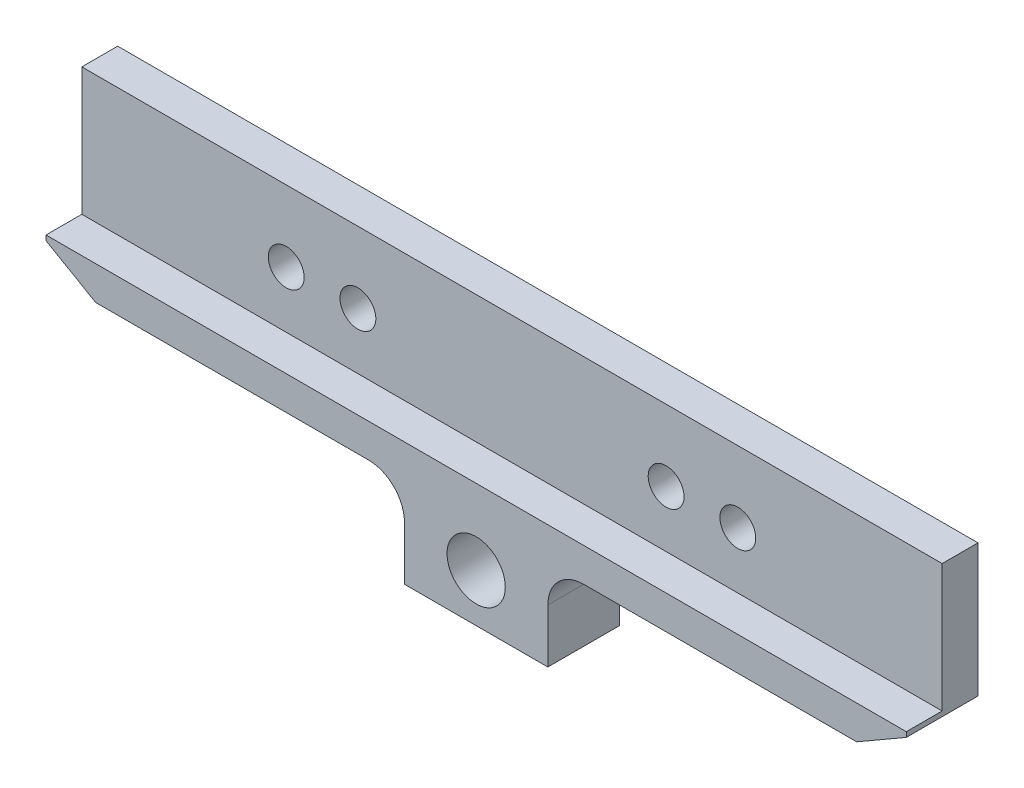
ISO-10303-21;
HEADER;
FILE_DESCRIPTION(('STEP AP214'),'2;1');
FILE_NAME('part.step','',(''),(''),'','','');
FILE_SCHEMA(('AUTOMOTIVE_DESIGN { 1 0 10303 214 1 1 1 1 }'));
ENDSEC;
DATA;
#1=APPLICATION_CONTEXT('core data for automotive mechanical design processes');
#2=APPLICATION_PROTOCOL_DEFINITION('international standard','automotive_design',2000,#1);
#3=PRODUCT_CONTEXT('',#1,'mechanical');
#4=PRODUCT('Part','Part','',(#3));
#5=PRODUCT_RELATED_PRODUCT_CATEGORY('part','',(#4));
#6=PRODUCT_DEFINITION_FORMATION('','',#4);
#7=PRODUCT_DEFINITION_CONTEXT('part definition',#1,'design');
#8=PRODUCT_DEFINITION('design','',#6,#7);
#9=PRODUCT_DEFINITION_SHAPE('','',#8);
#10=(LENGTH_UNIT() NAMED_UNIT(*) SI_UNIT(.MILLI.,.METRE.));
#11=(NAMED_UNIT(*) PLANE_ANGLE_UNIT() SI_UNIT($,.RADIAN.));
#12=(NAMED_UNIT(*) SI_UNIT($,.STERADIAN.) SOLID_ANGLE_UNIT());
#13=UNCERTAINTY_MEASURE_WITH_UNIT(LENGTH_MEASURE(1.E-05),#10,'distance_accuracy_value','');
#14=(GEOMETRIC_REPRESENTATION_CONTEXT(3) GLOBAL_UNCERTAINTY_ASSIGNED_CONTEXT((#13)) GLOBAL_UNIT_ASSIGNED_CONTEXT((#10,
#11,#12)) REPRESENTATION_CONTEXT('',''));
#15=CARTESIAN_POINT('',(0.,0.,0.));
#16=DIRECTION('',(0.,0.,1.));
#17=DIRECTION('',(1.,0.,0.));
#18=AXIS2_PLACEMENT_3D('',#15,#16,#17);
#19=CARTESIAN_POINT('',(0.,48.6918,3.175));
#20=DIRECTION('',(0.,0.,1.));
#21=DIRECTION('',(1.,0.,0.));
#22=AXIS2_PLACEMENT_3D('',#19,#20,#21);
#23=PLANE('',#22);
#24=DIRECTION('',(0.866025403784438,-0.5,0.));
#25=VECTOR('',#24,1.);
#26=CARTESIAN_POINT('',(-33.700590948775,-14.2875,3.175));
#27=LINE('',#26,#25);
#28=CARTESIAN_POINT('',(-38.1,-11.7475,3.175));
#29=VERTEX_POINT('',#28);
#30=CARTESIAN_POINT('',(-33.700590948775,-14.2875,3.175));
#31=VERTEX_POINT('',#30);
#32=EDGE_CURVE('E51',#29,#31,#27,.T.);
#33=ORIENTED_EDGE('',*,*,#32,.T.);
#34=DIRECTION('',(1.,0.,0.));
#35=VECTOR('',#34,1.);
#36=CARTESIAN_POINT('',(-9.52500000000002,-14.2875,3.175));
#37=LINE('',#36,#35);
#38=CARTESIAN_POINT('',(-9.52500000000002,-14.2875,3.175));
#39=VERTEX_POINT('',#38);
#40=EDGE_CURVE('E149',#31,#39,#37,.T.);
#41=ORIENTED_EDGE('',*,*,#40,.T.);
#42=CARTESIAN_POINT('',(-9.525,-17.4625,3.175));
#43=DIRECTION('',(0.,0.,-1.));
#44=DIRECTION('',(-1.,0.,0.));
#45=AXIS2_PLACEMENT_3D('',#42,#43,#44);
#46=CIRCLE('',#45,3.175);
#47=CARTESIAN_POINT('',(-6.35,-17.4625,3.175));
#48=VERTEX_POINT('',#47);
#49=EDGE_CURVE('E141',#39,#48,#46,.T.);
#50=ORIENTED_EDGE('',*,*,#49,.T.);
#51=DIRECTION('',(0.,-1.,0.));
#52=VECTOR('',#51,1.);
#53=CARTESIAN_POINT('',(-6.35,-22.225,3.175));
#54=LINE('',#53,#52);
#55=CARTESIAN_POINT('',(-6.35,-22.225,3.175));
#56=VERTEX_POINT('',#55);
#57=EDGE_CURVE('E152',#48,#56,#54,.T.);
#58=ORIENTED_EDGE('',*,*,#57,.T.);
#59=DIRECTION('',(1.,0.,0.));
#60=VECTOR('',#59,1.);
#61=CARTESIAN_POINT('',(-6.35,-22.225,3.175));
#62=LINE('',#61,#60);
#63=CARTESIAN_POINT('',(6.35,-22.225,3.175));
#64=VERTEX_POINT('',#63);
#65=EDGE_CURVE('E157',#56,#64,#62,.T.);
#66=ORIENTED_EDGE('',*,*,#65,.T.);
#67=DIRECTION('',(0.,1.,0.));
#68=VECTOR('',#67,1.);
#69=CARTESIAN_POINT('',(6.35,-22.225,3.175));
#70=LINE('',#69,#68);
#71=CARTESIAN_POINT('',(6.35,-17.4625,3.175));
#72=VERTEX_POINT('',#71);
#73=EDGE_CURVE('E168',#64,#72,#70,.T.);
#74=ORIENTED_EDGE('',*,*,#73,.T.);
#75=CARTESIAN_POINT('',(9.525,-17.4625,3.175));
#76=DIRECTION('',(0.,0.,-1.));
#77=DIRECTION('',(1.,0.,0.));
#78=AXIS2_PLACEMENT_3D('',#75,#76,#77);
#79=CIRCLE('',#78,3.175);
#80=CARTESIAN_POINT('',(9.52500000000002,-14.2875,3.175));
#81=VERTEX_POINT('',#80);
#82=EDGE_CURVE('E171',#72,#81,#79,.T.);
#83=ORIENTED_EDGE('',*,*,#82,.T.);
#84=DIRECTION('',(1.,0.,0.));
#85=VECTOR('',#84,1.);
#86=CARTESIAN_POINT('',(9.52500000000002,-14.2875,3.175));
#87=LINE('',#86,#85);
#88=CARTESIAN_POINT('',(33.700590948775,-14.2875,3.175));
#89=VERTEX_POINT('',#88);
#90=EDGE_CURVE('E174',#81,#89,#87,.T.);
#91=ORIENTED_EDGE('',*,*,#90,.T.);
#92=DIRECTION('',(0.866025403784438,0.5,0.));
#93=VECTOR('',#92,1.);
#94=CARTESIAN_POINT('',(33.700590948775,-14.2875,3.175));
#95=LINE('',#94,#93);
#96=CARTESIAN_POINT('',(38.1,-11.7475,3.175));
#97=VERTEX_POINT('',#96);
#98=EDGE_CURVE('E177',#89,#97,#95,.T.);
#99=ORIENTED_EDGE('',*,*,#98,.T.);
#100=DIRECTION('',(0.,1.,0.));
#101=VECTOR('',#100,1.);
#102=CARTESIAN_POINT('',(38.1,0.,3.175));
#103=LINE('',#102,#101);
#104=CARTESIAN_POINT('',(38.1,-11.3081999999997,3.175));
#105=VERTEX_POINT('',#104);
#106=EDGE_CURVE('E263',#97,#105,#103,.T.);
#107=ORIENTED_EDGE('',*,*,#106,.T.);
#108=DIRECTION('',(1.,0.,0.));
#109=VECTOR('',#108,1.);
#110=CARTESIAN_POINT('',(40.0000000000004,-11.3081999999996,3.175));
#111=LINE('',#110,#109);
#112=CARTESIAN_POINT('',(-38.1,-11.3082000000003,3.175));
#113=VERTEX_POINT('',#112);
#114=EDGE_CURVE('E203',#113,#105,#111,.T.);
#115=ORIENTED_EDGE('',*,*,#114,.F.);
#116=DIRECTION('',(0.,-1.,0.));
#117=VECTOR('',#116,1.);
#118=CARTESIAN_POINT('',(-38.1,0.,3.175));
#119=LINE('',#118,#117);
#120=EDGE_CURVE('E265',#113,#29,#119,.T.);
#121=ORIENTED_EDGE('',*,*,#120,.T.);
#122=EDGE_LOOP('',(#33,#41,#50,#58,#66,#74,#83,#91,#99,#107,#115,#121));
#123=FACE_BOUND('',#122,.T.);
#124=CARTESIAN_POINT('',(0.,-17.9832,3.175));
#125=DIRECTION('',(0.,0.,1.));
#126=DIRECTION('',(1.,0.,0.));
#127=AXIS2_PLACEMENT_3D('',#124,#125,#126);
#128=CIRCLE('',#127,2.57937);
#129=CARTESIAN_POINT('',(2.57937,-17.9832,3.175));
#130=VERTEX_POINT('',#129);
#131=EDGE_CURVE('E257',#130,#130,#128,.T.);
#132=ORIENTED_EDGE('',*,*,#131,.F.);
#133=EDGE_LOOP('',(#132));
#134=FACE_BOUND('',#133,.T.);
#135=ADVANCED_FACE('F36',(#123,#134),#23,.T.);
#136=CARTESIAN_POINT('',(0.,48.6918,-3.175));
#137=DIRECTION('',(0.,0.,1.));
#138=DIRECTION('',(1.,0.,0.));
#139=AXIS2_PLACEMENT_3D('',#136,#137,#138);
#140=PLANE('',#139);
#141=DIRECTION('',(1.,0.,0.));
#142=VECTOR('',#141,1.);
#143=CARTESIAN_POINT('',(-9.52500000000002,-14.2875,-3.175));
#144=LINE('',#143,#142);
#145=CARTESIAN_POINT('',(-33.700590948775,-14.2875,-3.175));
#146=VERTEX_POINT('',#145);
#147=CARTESIAN_POINT('',(-9.52500000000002,-14.2875,-3.175));
#148=VERTEX_POINT('',#147);
#149=EDGE_CURVE('E161',#146,#148,#144,.T.);
#150=ORIENTED_EDGE('',*,*,#149,.F.);
#151=DIRECTION('',(0.866025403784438,-0.5,0.));
#152=VECTOR('',#151,1.);
#153=CARTESIAN_POINT('',(-33.700590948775,-14.2875,-3.175));
#154=LINE('',#153,#152);
#155=CARTESIAN_POINT('',(-38.1,-11.7475,-3.175));
#156=VERTEX_POINT('',#155);
#157=EDGE_CURVE('E164',#156,#146,#154,.T.);
#158=ORIENTED_EDGE('',*,*,#157,.F.);
#159=DIRECTION('',(0.,-1.,0.));
#160=VECTOR('',#159,1.);
#161=CARTESIAN_POINT('',(-38.1,0.,-3.175));
#162=LINE('',#161,#160);
#163=CARTESIAN_POINT('',(-38.1,0.,-3.175));
#164=VERTEX_POINT('',#163);
#165=EDGE_CURVE('E266',#164,#156,#162,.T.);
#166=ORIENTED_EDGE('',*,*,#165,.F.);
#167=DIRECTION('',(-1.,0.,0.));
#168=VECTOR('',#167,1.);
#169=CARTESIAN_POINT('',(-38.1,0.,-3.175));
#170=LINE('',#169,#168);
#171=CARTESIAN_POINT('',(38.1,0.,-3.175));
#172=VERTEX_POINT('',#171);
#173=EDGE_CURVE('E271',#172,#164,#170,.T.);
#174=ORIENTED_EDGE('',*,*,#173,.F.);
#175=DIRECTION('',(0.,1.,0.));
#176=VECTOR('',#175,1.);
#177=CARTESIAN_POINT('',(38.1,0.,-3.175));
#178=LINE('',#177,#176);
#179=CARTESIAN_POINT('',(38.1,-11.7475,-3.175));
#180=VERTEX_POINT('',#179);
#181=EDGE_CURVE('E260',#180,#172,#178,.T.);
#182=ORIENTED_EDGE('',*,*,#181,.F.);
#183=DIRECTION('',(0.866025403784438,0.5,0.));
#184=VECTOR('',#183,1.);
#185=CARTESIAN_POINT('',(33.700590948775,-14.2875,-3.175));
#186=LINE('',#185,#184);
#187=CARTESIAN_POINT('',(33.700590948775,-14.2875,-3.175));
#188=VERTEX_POINT('',#187);
#189=EDGE_CURVE('E197',#188,#180,#186,.T.);
#190=ORIENTED_EDGE('',*,*,#189,.F.);
#191=DIRECTION('',(1.,0.,0.));
#192=VECTOR('',#191,1.);
#193=CARTESIAN_POINT('',(9.52500000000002,-14.2875,-3.175));
#194=LINE('',#193,#192);
#195=CARTESIAN_POINT('',(9.52500000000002,-14.2875,-3.175));
#196=VERTEX_POINT('',#195);
#197=EDGE_CURVE('E194',#196,#188,#194,.T.);
#198=ORIENTED_EDGE('',*,*,#197,.F.);
#199=CARTESIAN_POINT('',(9.525,-17.4625,-3.175));
#200=DIRECTION('',(0.,0.,-1.));
#201=DIRECTION('',(1.,0.,0.));
#202=AXIS2_PLACEMENT_3D('',#199,#200,#201);
#203=CIRCLE('',#202,3.175);
#204=CARTESIAN_POINT('',(6.35,-17.4625,-3.175));
#205=VERTEX_POINT('',#204);
#206=EDGE_CURVE('E191',#205,#196,#203,.T.);
#207=ORIENTED_EDGE('',*,*,#206,.F.);
#208=DIRECTION('',(0.,1.,0.));
#209=VECTOR('',#208,1.);
#210=CARTESIAN_POINT('',(6.35,-22.225,-3.175));
#211=LINE('',#210,#209);
#212=CARTESIAN_POINT('',(6.35,-22.225,-3.175));
#213=VERTEX_POINT('',#212);
#214=EDGE_CURVE('E188',#213,#205,#211,.T.);
#215=ORIENTED_EDGE('',*,*,#214,.F.);
#216=DIRECTION('',(1.,0.,0.));
#217=VECTOR('',#216,1.);
#218=CARTESIAN_POINT('',(-6.35,-22.225,-3.175));
#219=LINE('',#218,#217);
#220=CARTESIAN_POINT('',(-6.35,-22.225,-3.175));
#221=VERTEX_POINT('',#220);
#222=EDGE_CURVE('E185',#221,#213,#219,.T.);
#223=ORIENTED_EDGE('',*,*,#222,.F.);
#224=DIRECTION('',(0.,-1.,0.));
#225=VECTOR('',#224,1.);
#226=CARTESIAN_POINT('',(-6.35,-22.225,-3.175));
#227=LINE('',#226,#225);
#228=CARTESIAN_POINT('',(-6.35,-17.4625,-3.175));
#229=VERTEX_POINT('',#228);
#230=EDGE_CURVE('E183',#229,#221,#227,.T.);
#231=ORIENTED_EDGE('',*,*,#230,.F.);
#232=CARTESIAN_POINT('',(-9.525,-17.4625,-3.175));
#233=DIRECTION('',(0.,0.,-1.));
#234=DIRECTION('',(-1.,0.,0.));
#235=AXIS2_PLACEMENT_3D('',#232,#233,#234);
#236=CIRCLE('',#235,3.175);
#237=EDGE_CURVE('E144',#148,#229,#236,.T.);
#238=ORIENTED_EDGE('',*,*,#237,.F.);
#239=EDGE_LOOP('',(#150,#158,#166,#174,#182,#190,#198,#207,#215,#223,#231,#238));
#240=FACE_BOUND('',#239,.T.);
#241=CARTESIAN_POINT('',(13.6500000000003,-6.30819999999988,-3.175));
#242=DIRECTION('',(0.,0.,1.));
#243=DIRECTION('',(1.,0.,0.));
#244=AXIS2_PLACEMENT_3D('',#241,#242,#243);
#245=CIRCLE('',#244,1.588135);
#246=CARTESIAN_POINT('',(15.2381350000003,-6.30819999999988,-3.175));
#247=VERTEX_POINT('',#246);
#248=EDGE_CURVE('E247',#247,#247,#245,.T.);
#249=ORIENTED_EDGE('',*,*,#248,.T.);
#250=EDGE_LOOP('',(#249));
#251=FACE_BOUND('',#250,.T.);
#252=CARTESIAN_POINT('',(-20.0000000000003,-6.30820000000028,-3.175));
#253=DIRECTION('',(0.,0.,1.));
#254=DIRECTION('',(1.,0.,0.));
#255=AXIS2_PLACEMENT_3D('',#252,#253,#254);
#256=CIRCLE('',#255,1.588135);
#257=CARTESIAN_POINT('',(-18.4118650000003,-6.30820000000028,-3.175));
#258=VERTEX_POINT('',#257);
#259=EDGE_CURVE('E253',#258,#258,#256,.T.);
#260=ORIENTED_EDGE('',*,*,#259,.T.);
#261=EDGE_LOOP('',(#260));
#262=FACE_BOUND('',#261,.T.);
#263=CARTESIAN_POINT('',(0.,-17.9832,-3.175));
#264=DIRECTION('',(0.,0.,1.));
#265=DIRECTION('',(1.,0.,0.));
#266=AXIS2_PLACEMENT_3D('',#263,#264,#265);
#267=CIRCLE('',#266,2.57937);
#268=CARTESIAN_POINT('',(2.57937,-17.9832,-3.175));
#269=VERTEX_POINT('',#268);
#270=EDGE_CURVE('E256',#269,#269,#267,.T.);
#271=ORIENTED_EDGE('',*,*,#270,.T.);
#272=EDGE_LOOP('',(#271));
#273=FACE_BOUND('',#272,.T.);
#274=CARTESIAN_POINT('',(19.9999999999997,-6.30819999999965,-3.175));
#275=DIRECTION('',(0.,0.,1.));
#276=DIRECTION('',(1.,0.,0.));
#277=AXIS2_PLACEMENT_3D('',#274,#275,#276);
#278=CIRCLE('',#277,1.588135);
#279=CARTESIAN_POINT('',(21.5881349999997,-6.30819999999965,-3.175));
#280=VERTEX_POINT('',#279);
#281=EDGE_CURVE('E250',#280,#280,#278,.T.);
#282=ORIENTED_EDGE('',*,*,#281,.T.);
#283=EDGE_LOOP('',(#282));
#284=FACE_BOUND('',#283,.T.);
#285=CARTESIAN_POINT('',(-13.6500000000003,-6.30819999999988,-3.175));
#286=DIRECTION('',(0.,0.,1.));
#287=DIRECTION('',(1.,0.,0.));
#288=AXIS2_PLACEMENT_3D('',#285,#286,#287);
#289=CIRCLE('',#288,1.588135);
#290=CARTESIAN_POINT('',(-12.0618650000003,-6.30819999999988,-3.175));
#291=VERTEX_POINT('',#290);
#292=EDGE_CURVE('E244',#291,#291,#289,.T.);
#293=ORIENTED_EDGE('',*,*,#292,.T.);
#294=EDGE_LOOP('',(#293));
#295=FACE_BOUND('',#294,.T.);
#296=ADVANCED_FACE('F292',(#240,#251,#262,#273,#284,#295),#140,.F.);
#297=CARTESIAN_POINT('',(38.1,0.,3.175));
#298=DIRECTION('',(-1.,0.,0.));
#299=DIRECTION('',(0.,0.,1.));
#300=AXIS2_PLACEMENT_3D('',#297,#298,#299);
#301=PLANE('',#300);
#302=ORIENTED_EDGE('',*,*,#106,.F.);
#303=DIRECTION('',(0.,0.,-1.));
#304=VECTOR('',#303,1.);
#305=CARTESIAN_POINT('',(38.1,-11.7475,3.175));
#306=LINE('',#305,#304);
#307=EDGE_CURVE('E208',#97,#180,#306,.T.);
#308=ORIENTED_EDGE('',*,*,#307,.T.);
#309=ORIENTED_EDGE('',*,*,#181,.T.);
#310=DIRECTION('',(0.,0.,-1.));
#311=VECTOR('',#310,1.);
#312=CARTESIAN_POINT('',(38.1,0.,3.175));
#313=LINE('',#312,#311);
#314=CARTESIAN_POINT('',(38.1,0.,0.));
#315=VERTEX_POINT('',#314);
#316=EDGE_CURVE('E44',#315,#172,#313,.T.);
#317=ORIENTED_EDGE('',*,*,#316,.F.);
#318=DIRECTION('',(0.,-1.,0.));
#319=VECTOR('',#318,1.);
#320=CARTESIAN_POINT('',(38.1,0.,0.));
#321=LINE('',#320,#319);
#322=CARTESIAN_POINT('',(38.1,-11.3081999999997,0.));
#323=VERTEX_POINT('',#322);
#324=EDGE_CURVE('E238',#315,#323,#321,.T.);
#325=ORIENTED_EDGE('',*,*,#324,.T.);
#326=DIRECTION('',(0.,0.,1.));
#327=VECTOR('',#326,1.);
#328=CARTESIAN_POINT('',(38.1,-11.3081999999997,3.175));
#329=LINE('',#328,#327);
#330=EDGE_CURVE('E241',#323,#105,#329,.T.);
#331=ORIENTED_EDGE('',*,*,#330,.T.);
#332=EDGE_LOOP('',(#302,#308,#309,#317,#325,#331));
#333=FACE_BOUND('',#332,.T.);
#334=ADVANCED_FACE('F38',(#333),#301,.F.);
#335=CARTESIAN_POINT('',(-38.1,0.,3.175));
#336=DIRECTION('',(0.,-1.,0.));
#337=DIRECTION('',(0.,0.,-1.));
#338=AXIS2_PLACEMENT_3D('',#335,#336,#337);
#339=PLANE('',#338);
#340=DIRECTION('',(0.,0.,-1.));
#341=VECTOR('',#340,1.);
#342=CARTESIAN_POINT('',(-38.1,0.,3.175));
#343=LINE('',#342,#341);
#344=CARTESIAN_POINT('',(-38.1,0.,0.));
#345=VERTEX_POINT('',#344);
#346=EDGE_CURVE('E269',#345,#164,#343,.T.);
#347=ORIENTED_EDGE('',*,*,#346,.F.);
#348=DIRECTION('',(1.,0.,0.));
#349=VECTOR('',#348,1.);
#350=CARTESIAN_POINT('',(-38.1,0.,0.));
#351=LINE('',#350,#349);
#352=EDGE_CURVE('E59',#345,#315,#351,.T.);
#353=ORIENTED_EDGE('',*,*,#352,.T.);
#354=ORIENTED_EDGE('',*,*,#316,.T.);
#355=ORIENTED_EDGE('',*,*,#173,.T.);
#356=EDGE_LOOP('',(#347,#353,#354,#355));
#357=FACE_BOUND('',#356,.T.);
#358=ADVANCED_FACE('F300',(#357),#339,.F.);
#359=CARTESIAN_POINT('',(-38.1,0.,3.175));
#360=DIRECTION('',(1.,0.,0.));
#361=DIRECTION('',(0.,0.,-1.));
#362=AXIS2_PLACEMENT_3D('',#359,#360,#361);
#363=PLANE('',#362);
#364=ORIENTED_EDGE('',*,*,#165,.T.);
#365=DIRECTION('',(0.,0.,-1.));
#366=VECTOR('',#365,1.);
#367=CARTESIAN_POINT('',(-38.1,-11.7475,3.175));
#368=LINE('',#367,#366);
#369=EDGE_CURVE('E206',#29,#156,#368,.T.);
#370=ORIENTED_EDGE('',*,*,#369,.F.);
#371=ORIENTED_EDGE('',*,*,#120,.F.);
#372=DIRECTION('',(0.,0.,-1.));
#373=VECTOR('',#372,1.);
#374=CARTESIAN_POINT('',(-38.1,-11.3082000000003,3.175));
#375=LINE('',#374,#373);
#376=CARTESIAN_POINT('',(-38.1,-11.3082000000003,0.));
#377=VERTEX_POINT('',#376);
#378=EDGE_CURVE('E11',#113,#377,#375,.T.);
#379=ORIENTED_EDGE('',*,*,#378,.T.);
#380=DIRECTION('',(0.,1.,0.));
#381=VECTOR('',#380,1.);
#382=CARTESIAN_POINT('',(-38.1,0.,0.));
#383=LINE('',#382,#381);
#384=EDGE_CURVE('E235',#377,#345,#383,.T.);
#385=ORIENTED_EDGE('',*,*,#384,.T.);
#386=ORIENTED_EDGE('',*,*,#346,.T.);
#387=EDGE_LOOP('',(#364,#370,#371,#379,#385,#386));
#388=FACE_BOUND('',#387,.T.);
#389=ADVANCED_FACE('F307',(#388),#363,.F.);
#390=CARTESIAN_POINT('',(0.,-17.9832,3.175));
#391=DIRECTION('',(0.,0.,-1.));
#392=DIRECTION('',(-1.,0.,0.));
#393=AXIS2_PLACEMENT_3D('',#390,#391,#392);
#394=CYLINDRICAL_SURFACE('',#393,2.57937);
#395=ORIENTED_EDGE('',*,*,#131,.T.);
#396=EDGE_LOOP('',(#395));
#397=FACE_BOUND('',#396,.T.);
#398=ORIENTED_EDGE('',*,*,#270,.F.);
#399=EDGE_LOOP('',(#398));
#400=FACE_BOUND('',#399,.T.);
#401=ADVANCED_FACE('F309',(#397,#400),#394,.F.);
#402=CARTESIAN_POINT('',(-20.0000000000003,-6.30820000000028,3.175));
#403=DIRECTION('',(0.,0.,-1.));
#404=DIRECTION('',(-1.,0.,0.));
#405=AXIS2_PLACEMENT_3D('',#402,#403,#404);
#406=CYLINDRICAL_SURFACE('',#405,1.588135);
#407=CARTESIAN_POINT('',(-20.0000000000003,-6.30820000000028,0.));
#408=DIRECTION('',(0.,0.,-1.));
#409=DIRECTION('',(-1.,0.,0.));
#410=AXIS2_PLACEMENT_3D('',#407,#408,#409);
#411=CIRCLE('',#410,1.588135);
#412=CARTESIAN_POINT('',(-21.5881350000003,-6.30820000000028,0.));
#413=VERTEX_POINT('',#412);
#414=EDGE_CURVE('E232',#413,#413,#411,.T.);
#415=ORIENTED_EDGE('',*,*,#414,.F.);
#416=EDGE_LOOP('',(#415));
#417=FACE_BOUND('',#416,.T.);
#418=ORIENTED_EDGE('',*,*,#259,.F.);
#419=EDGE_LOOP('',(#418));
#420=FACE_BOUND('',#419,.T.);
#421=ADVANCED_FACE('F369',(#417,#420),#406,.F.);
#422=CARTESIAN_POINT('',(19.9999999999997,-6.30819999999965,3.175));
#423=DIRECTION('',(0.,0.,-1.));
#424=DIRECTION('',(-1.,0.,0.));
#425=AXIS2_PLACEMENT_3D('',#422,#423,#424);
#426=CYLINDRICAL_SURFACE('',#425,1.588135);
#427=CARTESIAN_POINT('',(19.9999999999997,-6.30819999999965,0.));
#428=DIRECTION('',(0.,0.,-1.));
#429=DIRECTION('',(-1.,0.,0.));
#430=AXIS2_PLACEMENT_3D('',#427,#428,#429);
#431=CIRCLE('',#430,1.588135);
#432=CARTESIAN_POINT('',(18.4118649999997,-6.30819999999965,0.));
#433=VERTEX_POINT('',#432);
#434=EDGE_CURVE('E229',#433,#433,#431,.T.);
#435=ORIENTED_EDGE('',*,*,#434,.F.);
#436=EDGE_LOOP('',(#435));
#437=FACE_BOUND('',#436,.T.);
#438=ORIENTED_EDGE('',*,*,#281,.F.);
#439=EDGE_LOOP('',(#438));
#440=FACE_BOUND('',#439,.T.);
#441=ADVANCED_FACE('F365',(#437,#440),#426,.F.);
#442=CARTESIAN_POINT('',(13.6500000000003,-6.30819999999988,3.175));
#443=DIRECTION('',(0.,0.,-1.));
#444=DIRECTION('',(-1.,0.,0.));
#445=AXIS2_PLACEMENT_3D('',#442,#443,#444);
#446=CYLINDRICAL_SURFACE('',#445,1.588135);
#447=CARTESIAN_POINT('',(13.6500000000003,-6.30819999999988,0.));
#448=DIRECTION('',(0.,0.,-1.));
#449=DIRECTION('',(-1.,0.,0.));
#450=AXIS2_PLACEMENT_3D('',#447,#448,#449);
#451=CIRCLE('',#450,1.588135);
#452=CARTESIAN_POINT('',(12.0618650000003,-6.30819999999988,0.));
#453=VERTEX_POINT('',#452);
#454=EDGE_CURVE('E226',#453,#453,#451,.T.);
#455=ORIENTED_EDGE('',*,*,#454,.F.);
#456=EDGE_LOOP('',(#455));
#457=FACE_BOUND('',#456,.T.);
#458=ORIENTED_EDGE('',*,*,#248,.F.);
#459=EDGE_LOOP('',(#458));
#460=FACE_BOUND('',#459,.T.);
#461=ADVANCED_FACE('F288',(#457,#460),#446,.F.);
#462=CARTESIAN_POINT('',(-13.6500000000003,-6.30819999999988,3.175));
#463=DIRECTION('',(0.,0.,-1.));
#464=DIRECTION('',(-1.,0.,0.));
#465=AXIS2_PLACEMENT_3D('',#462,#463,#464);
#466=CYLINDRICAL_SURFACE('',#465,1.588135);
#467=CARTESIAN_POINT('',(-13.6500000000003,-6.30819999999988,0.));
#468=DIRECTION('',(0.,0.,-1.));
#469=DIRECTION('',(-1.,0.,0.));
#470=AXIS2_PLACEMENT_3D('',#467,#468,#469);
#471=CIRCLE('',#470,1.588135);
#472=CARTESIAN_POINT('',(-15.2381350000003,-6.30819999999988,0.));
#473=VERTEX_POINT('',#472);
#474=EDGE_CURVE('E223',#473,#473,#471,.T.);
#475=ORIENTED_EDGE('',*,*,#474,.F.);
#476=EDGE_LOOP('',(#475));
#477=FACE_BOUND('',#476,.T.);
#478=ORIENTED_EDGE('',*,*,#292,.F.);
#479=EDGE_LOOP('',(#478));
#480=FACE_BOUND('',#479,.T.);
#481=ADVANCED_FACE('F284',(#477,#480),#466,.F.);
#482=CARTESIAN_POINT('',(40.0000000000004,-11.3081999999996,0.));
#483=DIRECTION('',(0.,-1.,0.));
#484=DIRECTION('',(1.,0.,0.));
#485=AXIS2_PLACEMENT_3D('',#482,#483,#484);
#486=PLANE('',#485);
#487=DIRECTION('',(1.,0.,0.));
#488=VECTOR('',#487,1.);
#489=CARTESIAN_POINT('',(40.0000000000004,-11.3081999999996,0.));
#490=LINE('',#489,#488);
#491=EDGE_CURVE('E220',#377,#323,#490,.T.);
#492=ORIENTED_EDGE('',*,*,#491,.F.);
#493=ORIENTED_EDGE('',*,*,#378,.F.);
#494=ORIENTED_EDGE('',*,*,#114,.T.);
#495=ORIENTED_EDGE('',*,*,#330,.F.);
#496=EDGE_LOOP('',(#492,#493,#494,#495));
#497=FACE_BOUND('',#496,.T.);
#498=ADVANCED_FACE('F287',(#497),#486,.F.);
#499=CARTESIAN_POINT('',(40.0000000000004,-11.3081999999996,0.));
#500=DIRECTION('',(0.,0.,-1.));
#501=DIRECTION('',(-1.,0.,0.));
#502=AXIS2_PLACEMENT_3D('',#499,#500,#501);
#503=PLANE('',#502);
#504=ORIENTED_EDGE('',*,*,#474,.T.);
#505=EDGE_LOOP('',(#504));
#506=FACE_BOUND('',#505,.T.);
#507=ORIENTED_EDGE('',*,*,#454,.T.);
#508=EDGE_LOOP('',(#507));
#509=FACE_BOUND('',#508,.T.);
#510=ORIENTED_EDGE('',*,*,#434,.T.);
#511=EDGE_LOOP('',(#510));
#512=FACE_BOUND('',#511,.T.);
#513=ORIENTED_EDGE('',*,*,#414,.T.);
#514=EDGE_LOOP('',(#513));
#515=FACE_BOUND('',#514,.T.);
#516=ORIENTED_EDGE('',*,*,#352,.F.);
#517=ORIENTED_EDGE('',*,*,#384,.F.);
#518=ORIENTED_EDGE('',*,*,#491,.T.);
#519=ORIENTED_EDGE('',*,*,#324,.F.);
#520=EDGE_LOOP('',(#516,#517,#518,#519));
#521=FACE_BOUND('',#520,.T.);
#522=ADVANCED_FACE('F281',(#506,#509,#512,#515,#521),#503,.F.);
#523=CARTESIAN_POINT('',(-9.525,-17.4625,3.175));
#524=DIRECTION('',(0.,0.,-1.));
#525=DIRECTION('',(-1.,0.,0.));
#526=AXIS2_PLACEMENT_3D('',#523,#524,#525);
#527=CYLINDRICAL_SURFACE('',#526,3.175);
#528=ORIENTED_EDGE('',*,*,#237,.T.);
#529=DIRECTION('',(0.,0.,-1.));
#530=VECTOR('',#529,1.);
#531=CARTESIAN_POINT('',(-6.35,-17.4625,3.175));
#532=LINE('',#531,#530);
#533=EDGE_CURVE('E137',#48,#229,#532,.T.);
#534=ORIENTED_EDGE('',*,*,#533,.F.);
#535=ORIENTED_EDGE('',*,*,#49,.F.);
#536=DIRECTION('',(0.,0.,-1.));
#537=VECTOR('',#536,1.);
#538=CARTESIAN_POINT('',(-9.52500000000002,-14.2875,3.175));
#539=LINE('',#538,#537);
#540=EDGE_CURVE('E201',#39,#148,#539,.T.);
#541=ORIENTED_EDGE('',*,*,#540,.T.);
#542=EDGE_LOOP('',(#528,#534,#535,#541));
#543=FACE_BOUND('',#542,.T.);
#544=ADVANCED_FACE('F139',(#543),#527,.F.);
#545=CARTESIAN_POINT('',(-9.52500000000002,-14.2875,3.175));
#546=DIRECTION('',(0.,1.,0.));
#547=DIRECTION('',(-1.,0.,0.));
#548=AXIS2_PLACEMENT_3D('',#545,#546,#547);
#549=PLANE('',#548);
#550=ORIENTED_EDGE('',*,*,#149,.T.);
#551=ORIENTED_EDGE('',*,*,#540,.F.);
#552=ORIENTED_EDGE('',*,*,#40,.F.);
#553=DIRECTION('',(0.,0.,-1.));
#554=VECTOR('',#553,1.);
#555=CARTESIAN_POINT('',(-33.700590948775,-14.2875,3.175));
#556=LINE('',#555,#554);
#557=EDGE_CURVE('E204',#31,#146,#556,.T.);
#558=ORIENTED_EDGE('',*,*,#557,.T.);
#559=EDGE_LOOP('',(#550,#551,#552,#558));
#560=FACE_BOUND('',#559,.T.);
#561=ADVANCED_FACE('F358',(#560),#549,.F.);
#562=CARTESIAN_POINT('',(-33.700590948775,-14.2875,3.175));
#563=DIRECTION('',(0.5,0.866025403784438,0.));
#564=DIRECTION('',(-0.866025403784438,0.5,0.));
#565=AXIS2_PLACEMENT_3D('',#562,#563,#564);
#566=PLANE('',#565);
#567=ORIENTED_EDGE('',*,*,#157,.T.);
#568=ORIENTED_EDGE('',*,*,#557,.F.);
#569=ORIENTED_EDGE('',*,*,#32,.F.);
#570=ORIENTED_EDGE('',*,*,#369,.T.);
#571=EDGE_LOOP('',(#567,#568,#569,#570));
#572=FACE_BOUND('',#571,.T.);
#573=ADVANCED_FACE('F327',(#572),#566,.F.);
#574=CARTESIAN_POINT('',(33.700590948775,-14.2875,3.175));
#575=DIRECTION('',(-0.5,0.866025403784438,0.));
#576=DIRECTION('',(-0.866025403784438,-0.5,0.));
#577=AXIS2_PLACEMENT_3D('',#574,#575,#576);
#578=PLANE('',#577);
#579=ORIENTED_EDGE('',*,*,#189,.T.);
#580=ORIENTED_EDGE('',*,*,#307,.F.);
#581=ORIENTED_EDGE('',*,*,#98,.F.);
#582=DIRECTION('',(0.,0.,-1.));
#583=VECTOR('',#582,1.);
#584=CARTESIAN_POINT('',(33.700590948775,-14.2875,3.175));
#585=LINE('',#584,#583);
#586=EDGE_CURVE('E211',#89,#188,#585,.T.);
#587=ORIENTED_EDGE('',*,*,#586,.T.);
#588=EDGE_LOOP('',(#579,#580,#581,#587));
#589=FACE_BOUND('',#588,.T.);
#590=ADVANCED_FACE('F331',(#589),#578,.F.);
#591=CARTESIAN_POINT('',(9.52500000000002,-14.2875,3.175));
#592=DIRECTION('',(0.,1.,0.));
#593=DIRECTION('',(-1.,0.,0.));
#594=AXIS2_PLACEMENT_3D('',#591,#592,#593);
#595=PLANE('',#594);
#596=ORIENTED_EDGE('',*,*,#197,.T.);
#597=ORIENTED_EDGE('',*,*,#586,.F.);
#598=ORIENTED_EDGE('',*,*,#90,.F.);
#599=DIRECTION('',(0.,0.,-1.));
#600=VECTOR('',#599,1.);
#601=CARTESIAN_POINT('',(9.52500000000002,-14.2875,3.175));
#602=LINE('',#601,#600);
#603=EDGE_CURVE('E213',#81,#196,#602,.T.);
#604=ORIENTED_EDGE('',*,*,#603,.T.);
#605=EDGE_LOOP('',(#596,#597,#598,#604));
#606=FACE_BOUND('',#605,.T.);
#607=ADVANCED_FACE('F336',(#606),#595,.F.);
#608=CARTESIAN_POINT('',(9.525,-17.4625,3.175));
#609=DIRECTION('',(0.,0.,-1.));
#610=DIRECTION('',(-1.,0.,0.));
#611=AXIS2_PLACEMENT_3D('',#608,#609,#610);
#612=CYLINDRICAL_SURFACE('',#611,3.175);
#613=ORIENTED_EDGE('',*,*,#206,.T.);
#614=ORIENTED_EDGE('',*,*,#603,.F.);
#615=ORIENTED_EDGE('',*,*,#82,.F.);
#616=DIRECTION('',(0.,0.,-1.));
#617=VECTOR('',#616,1.);
#618=CARTESIAN_POINT('',(6.35,-17.4625,3.175));
#619=LINE('',#618,#617);
#620=EDGE_CURVE('E215',#72,#205,#619,.T.);
#621=ORIENTED_EDGE('',*,*,#620,.T.);
#622=EDGE_LOOP('',(#613,#614,#615,#621));
#623=FACE_BOUND('',#622,.T.);
#624=ADVANCED_FACE('F339',(#623),#612,.F.);
#625=CARTESIAN_POINT('',(6.35,-22.225,3.175));
#626=DIRECTION('',(-1.,0.,0.));
#627=DIRECTION('',(0.,0.,1.));
#628=AXIS2_PLACEMENT_3D('',#625,#626,#627);
#629=PLANE('',#628);
#630=ORIENTED_EDGE('',*,*,#214,.T.);
#631=ORIENTED_EDGE('',*,*,#620,.F.);
#632=ORIENTED_EDGE('',*,*,#73,.F.);
#633=DIRECTION('',(0.,0.,-1.));
#634=VECTOR('',#633,1.);
#635=CARTESIAN_POINT('',(6.35,-22.225,3.175));
#636=LINE('',#635,#634);
#637=EDGE_CURVE('E217',#64,#213,#636,.T.);
#638=ORIENTED_EDGE('',*,*,#637,.T.);
#639=EDGE_LOOP('',(#630,#631,#632,#638));
#640=FACE_BOUND('',#639,.T.);
#641=ADVANCED_FACE('F342',(#640),#629,.F.);
#642=CARTESIAN_POINT('',(-6.35,-22.225,3.175));
#643=DIRECTION('',(0.,1.,0.));
#644=DIRECTION('',(0.,0.,1.));
#645=AXIS2_PLACEMENT_3D('',#642,#643,#644);
#646=PLANE('',#645);
#647=ORIENTED_EDGE('',*,*,#222,.T.);
#648=ORIENTED_EDGE('',*,*,#637,.F.);
#649=ORIENTED_EDGE('',*,*,#65,.F.);
#650=DIRECTION('',(0.,0.,-1.));
#651=VECTOR('',#650,1.);
#652=CARTESIAN_POINT('',(-6.35,-22.225,3.175));
#653=LINE('',#652,#651);
#654=EDGE_CURVE('E148',#56,#221,#653,.T.);
#655=ORIENTED_EDGE('',*,*,#654,.T.);
#656=EDGE_LOOP('',(#647,#648,#649,#655));
#657=FACE_BOUND('',#656,.T.);
#658=ADVANCED_FACE('F345',(#657),#646,.F.);
#659=CARTESIAN_POINT('',(-6.35,-22.225,3.175));
#660=DIRECTION('',(1.,0.,0.));
#661=DIRECTION('',(0.,1.,0.));
#662=AXIS2_PLACEMENT_3D('',#659,#660,#661);
#663=PLANE('',#662);
#664=ORIENTED_EDGE('',*,*,#230,.T.);
#665=ORIENTED_EDGE('',*,*,#654,.F.);
#666=ORIENTED_EDGE('',*,*,#57,.F.);
#667=ORIENTED_EDGE('',*,*,#533,.T.);
#668=EDGE_LOOP('',(#664,#665,#666,#667));
#669=FACE_BOUND('',#668,.T.);
#670=ADVANCED_FACE('F153',(#669),#663,.F.);
#671=CLOSED_SHELL('',(#135,#296,#334,#358,#389,#401,#421,#441,#461,#481,#498,#522,#544,#561,
#573,#590,#607,#624,#641,#658,#670));
#672=MANIFOLD_SOLID_BREP('B2',#671);
#673=ADVANCED_BREP_SHAPE_REPRESENTATION('',(#18,#672),#14);
#674=SHAPE_DEFINITION_REPRESENTATION(#9,#673);
ENDSEC;
END-ISO-10303-21;
